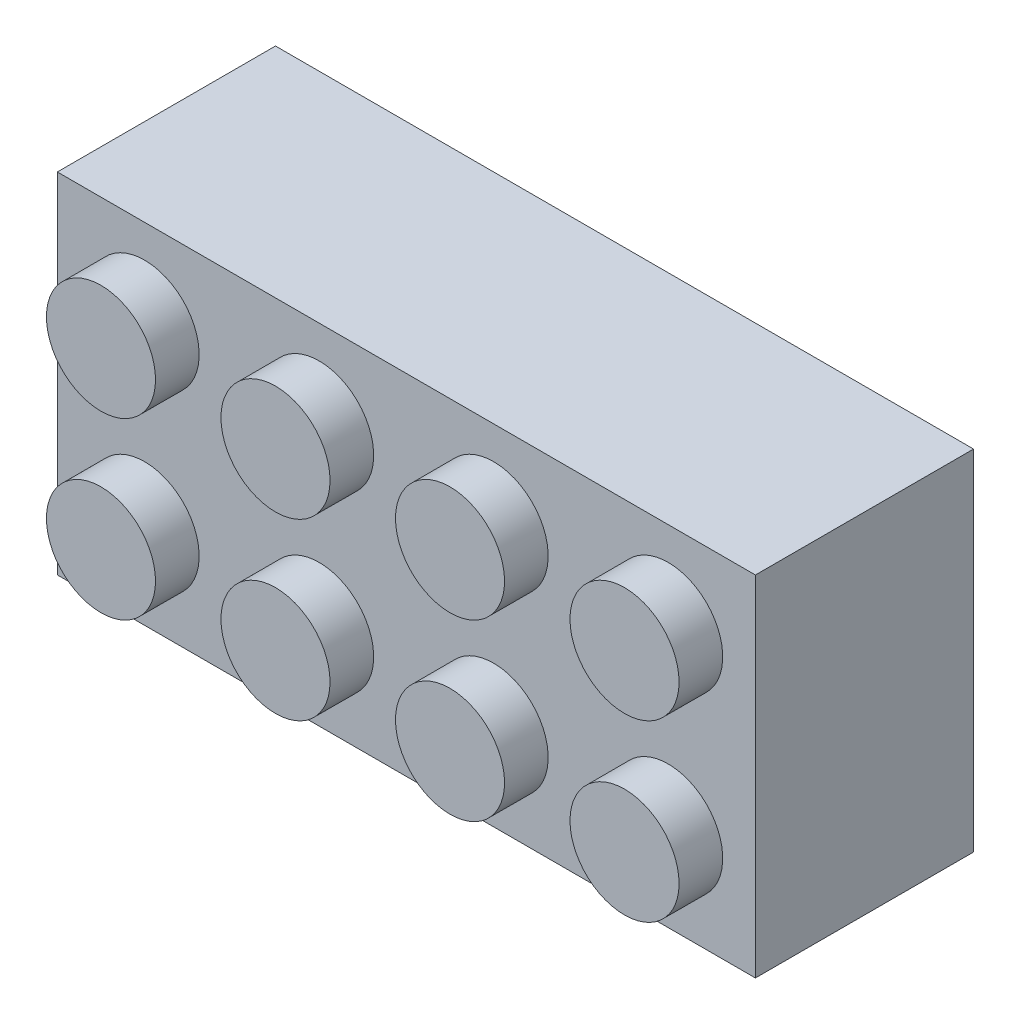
from build123d import *

# Parameters (mm, degrees)
ESQUISSE1_W                     = 32
ESQUISSE1_H                     = 16
BOSS_EXTRU_1_DEPTH              = 10
ESQUISSE2_R                     = 2.5
BOSS_EXTRU_2_DEPTH              = 2
R_P_TITION_LIN_AIRE1_COUNT      = 4
R_P_TITION_LIN_AIRE1_PITCH      = 8
R_P_TITION_LIN_AIRE1_COUNT_DIR2 = 2
R_P_TITION_LIN_AIRE1_PITCH_DIR2 = 8
COQUE1_T                        = -1
ESQUISSE3_R                     = 3
ESQUISSE3_R_2                   = 2.5
BOSS_EXTRU_3_DEPTH              = 9
R_P_TITION_LIN_AIRE2_COUNT      = 3
R_P_TITION_LIN_AIRE2_PITCH      = 8


with BuildPart() as part:
    # Esquisse1 → Boss.-Extru.1 (new body)
    with BuildSketch(Plane.XY):
        with Locations((16, 8)):
            Rectangle(ESQUISSE1_W, ESQUISSE1_H)
    extrude(amount=BOSS_EXTRU_1_DEPTH)

    # Esquisse2 → Boss.-Extru.2 (add)
    with BuildSketch(Plane.XY.offset(10)):
        with Locations(Location((4, 12, 0), (0, 0, 180))):
            Circle(ESQUISSE2_R)
    boss_extru_2 = extrude(amount=BOSS_EXTRU_2_DEPTH)

    # R_p_tition lin_aire1: Boss.-Extru.2 4 × 2
    with Locations(*[(i * R_P_TITION_LIN_AIRE1_PITCH, -j * R_P_TITION_LIN_AIRE1_PITCH_DIR2, 0) for i in range(R_P_TITION_LIN_AIRE1_COUNT) for j in range(R_P_TITION_LIN_AIRE1_COUNT_DIR2) if (i, j) != (0, 0)]):
        add(boss_extru_2)

    # Coque1
    coque1_openings = [part.faces().sort_by_distance(p)[0] for p in [
        (16, 8, 0),
    ]]
    offset(amount=COQUE1_T, openings=coque1_openings, kind=Kind.INTERSECTION)

    # Esquisse3 → Boss.-Extru.3 (add)
    with BuildSketch(Plane(origin=(0, 0, 9), x_dir=(-1, 0, 0), z_dir=(0, 0, -1))):
        with Locations((-8, 8)):
            Circle(ESQUISSE3_R)
        with Locations((-8, 8)):
            Circle(ESQUISSE3_R_2, mode=Mode.SUBTRACT)
    boss_extru_3 = extrude(amount=BOSS_EXTRU_3_DEPTH)

    # R_p_tition lin_aire2: Boss.-Extru.3 ×3
    with Locations(*[(i * R_P_TITION_LIN_AIRE2_PITCH, 0, 0) for i in range(1, R_P_TITION_LIN_AIRE2_COUNT)]):
        add(boss_extru_3)


solid = part.part
